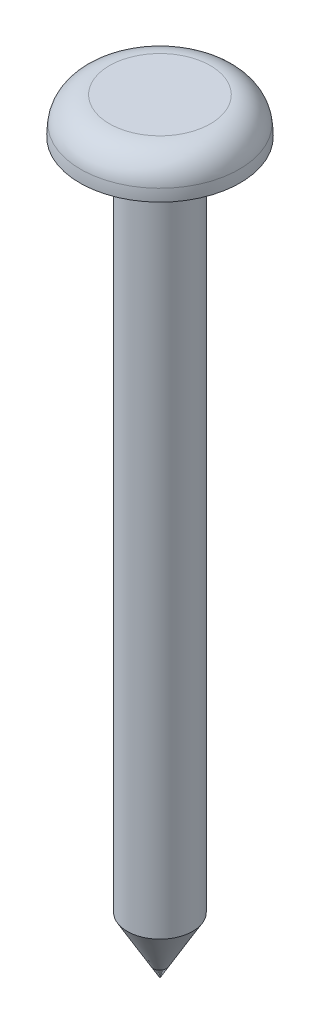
from build123d import *


with BuildPart() as part:
    # Esquisse1 → R_volution1 (revolve)
    with BuildSketch(Plane.XY):
        with BuildLine():
            Line((-0.9, 0), (-0.9, -18.441154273))
            Line((-0.9, -18.441154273), (0, -20))
            Line((0, -20), (0, 1))
            Line((0, 1), (-1.385640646, 1))
            ThreePointArc((-1.385640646, 1), (-1.909363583, 0.804743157), (-2.177435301, 0.314285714))
            ThreePointArc((-2.177435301, 0.314285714), (-2.194351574, 0.157547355), (-2.2, 0))
            Line((-2.2, 0), (-0.9, 0))
        make_face()
    revolve(axis=Axis((0, 1, 0), (0, -1, 0)))


solid = part.part
